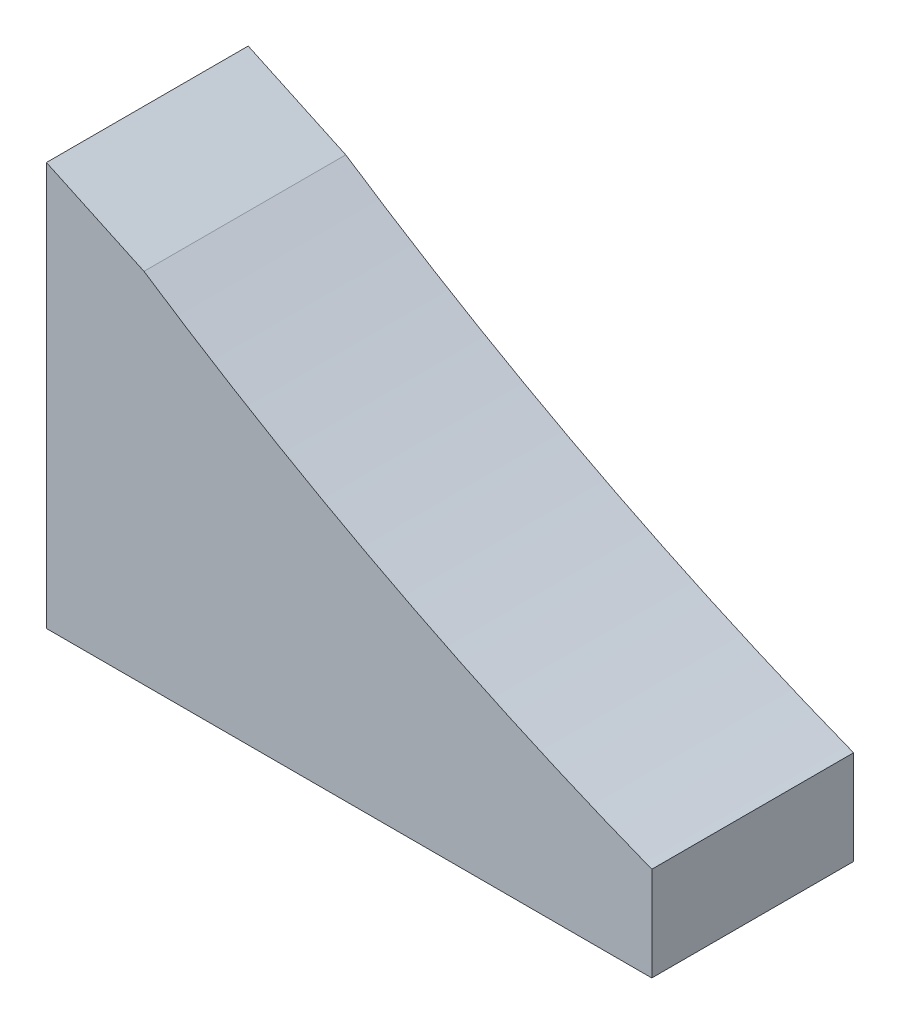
from build123d import *

# Parameters (mm, degrees)
SKETCH1_W           = 28.575
SKETCH1_H           = 9.525
BOSS_EXTRUDE1_DEPTH = 19.05
CUT_EXTRUDE1_DEPTH  = 26.646847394
SKETCH4_R           = 1.905
CUT_EXTRUDE2_DEPTH  = 5.08


with BuildPart() as part:
    # Sketch1 → Boss-Extrude1 (new body)
    with BuildSketch(Plane(origin=(0, 0, 0), x_dir=(1, 0, 0), z_dir=(0, 1, 0))):
        Rectangle(SKETCH1_W, SKETCH1_H)
    extrude(amount=BOSS_EXTRUDE1_DEPTH)

    # Sketch3 → Cut-Extrude1 (cut, through all)
    with BuildSketch(Plane.XY.offset(4.7625)):
        with BuildLine():
            Line((-14.2875, 19.05), (-9.683456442, 16.90309923))
            ThreePointArc((-9.683456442, 16.90309923), (1.969824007, 10.034859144), (14.2875, 4.445))
            Line((14.2875, 4.445), (14.2875, 19.05))
            Line((14.2875, 19.05), (-14.2875, 19.05))
        make_face()
    extrude(amount=-CUT_EXTRUDE1_DEPTH, mode=Mode.SUBTRACT)

    # Sketch4 → Cut-Extrude2 (cut)
    with BuildSketch(Plane.XZ):
        with Locations(Location((-9.525, 0, 0), (0, 0, 270))):
            Circle(SKETCH4_R)
        with Locations(Location((9.525, 0, 0), (0, 0, 270))):
            Circle(SKETCH4_R)
    extrude(amount=-CUT_EXTRUDE2_DEPTH, mode=Mode.SUBTRACT)


solid = part.part
